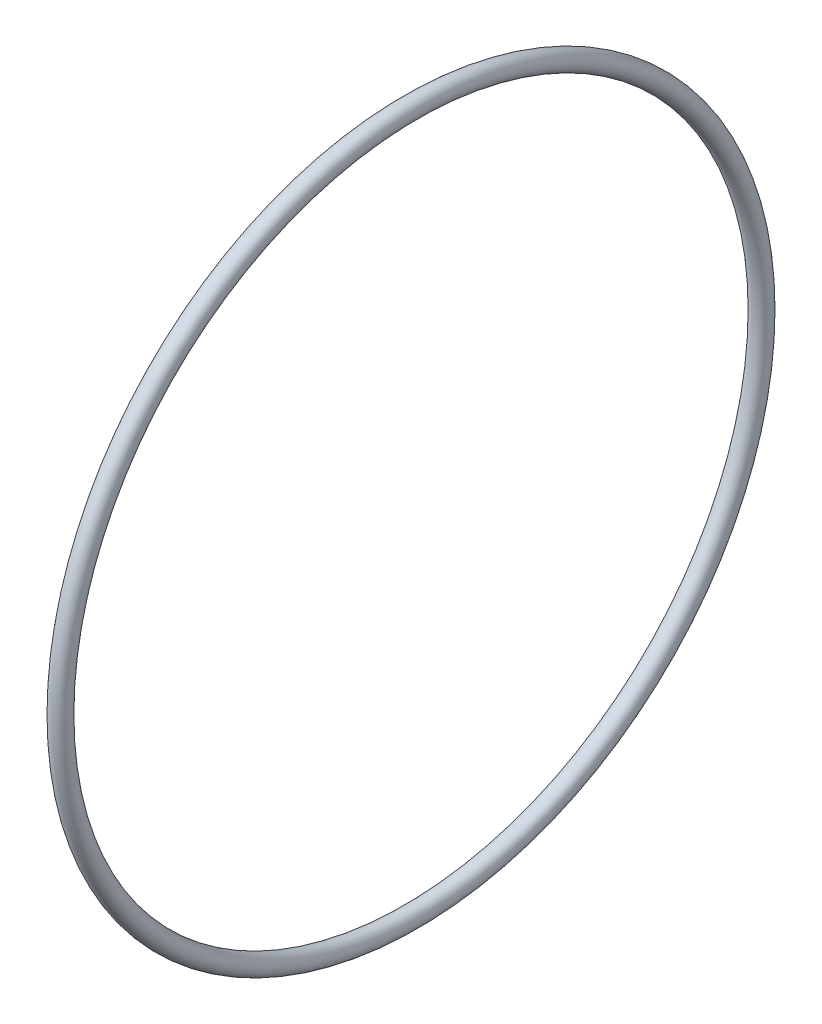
ISO-10303-21;
HEADER;
FILE_DESCRIPTION(('STEP AP214'),'2;1');
FILE_NAME('part.step','',(''),(''),'','','');
FILE_SCHEMA(('AUTOMOTIVE_DESIGN { 1 0 10303 214 1 1 1 1 }'));
ENDSEC;
DATA;
#1=APPLICATION_CONTEXT('core data for automotive mechanical design processes');
#2=APPLICATION_PROTOCOL_DEFINITION('international standard','automotive_design',2000,#1);
#3=PRODUCT_CONTEXT('',#1,'mechanical');
#4=PRODUCT('Part','Part','',(#3));
#5=PRODUCT_RELATED_PRODUCT_CATEGORY('part','',(#4));
#6=PRODUCT_DEFINITION_FORMATION('','',#4);
#7=PRODUCT_DEFINITION_CONTEXT('part definition',#1,'design');
#8=PRODUCT_DEFINITION('design','',#6,#7);
#9=PRODUCT_DEFINITION_SHAPE('','',#8);
#10=(LENGTH_UNIT() NAMED_UNIT(*) SI_UNIT(.MILLI.,.METRE.));
#11=(NAMED_UNIT(*) PLANE_ANGLE_UNIT() SI_UNIT($,.RADIAN.));
#12=(NAMED_UNIT(*) SI_UNIT($,.STERADIAN.) SOLID_ANGLE_UNIT());
#13=UNCERTAINTY_MEASURE_WITH_UNIT(LENGTH_MEASURE(1.E-05),#10,'distance_accuracy_value','');
#14=(GEOMETRIC_REPRESENTATION_CONTEXT(3) GLOBAL_UNCERTAINTY_ASSIGNED_CONTEXT((#13)) GLOBAL_UNIT_ASSIGNED_CONTEXT((#10,
#11,#12)) REPRESENTATION_CONTEXT('',''));
#15=CARTESIAN_POINT('',(0.,0.,0.));
#16=DIRECTION('',(0.,0.,1.));
#17=DIRECTION('',(1.,0.,0.));
#18=AXIS2_PLACEMENT_3D('',#15,#16,#17);
#19=CARTESIAN_POINT('',(0.,0.,0.));
#20=DIRECTION('',(-1.,0.,0.));
#21=DIRECTION('',(0.,0.,1.));
#22=AXIS2_PLACEMENT_3D('',#19,#20,#21);
#23=TOROIDAL_SURFACE('',#22,65.0621,1.7653);
#24=CARTESIAN_POINT('',(0.,0.,66.8274));
#25=VERTEX_POINT('',#24);
#26=VERTEX_LOOP('',#25);
#27=FACE_BOUND('',#26,.T.);
#28=ADVANCED_FACE('F32',(#27),#23,.T.);
#29=CLOSED_SHELL('',(#28));
#30=MANIFOLD_SOLID_BREP('B2',#29);
#31=ADVANCED_BREP_SHAPE_REPRESENTATION('',(#18,#30),#14);
#32=SHAPE_DEFINITION_REPRESENTATION(#9,#31);
ENDSEC;
END-ISO-10303-21;
